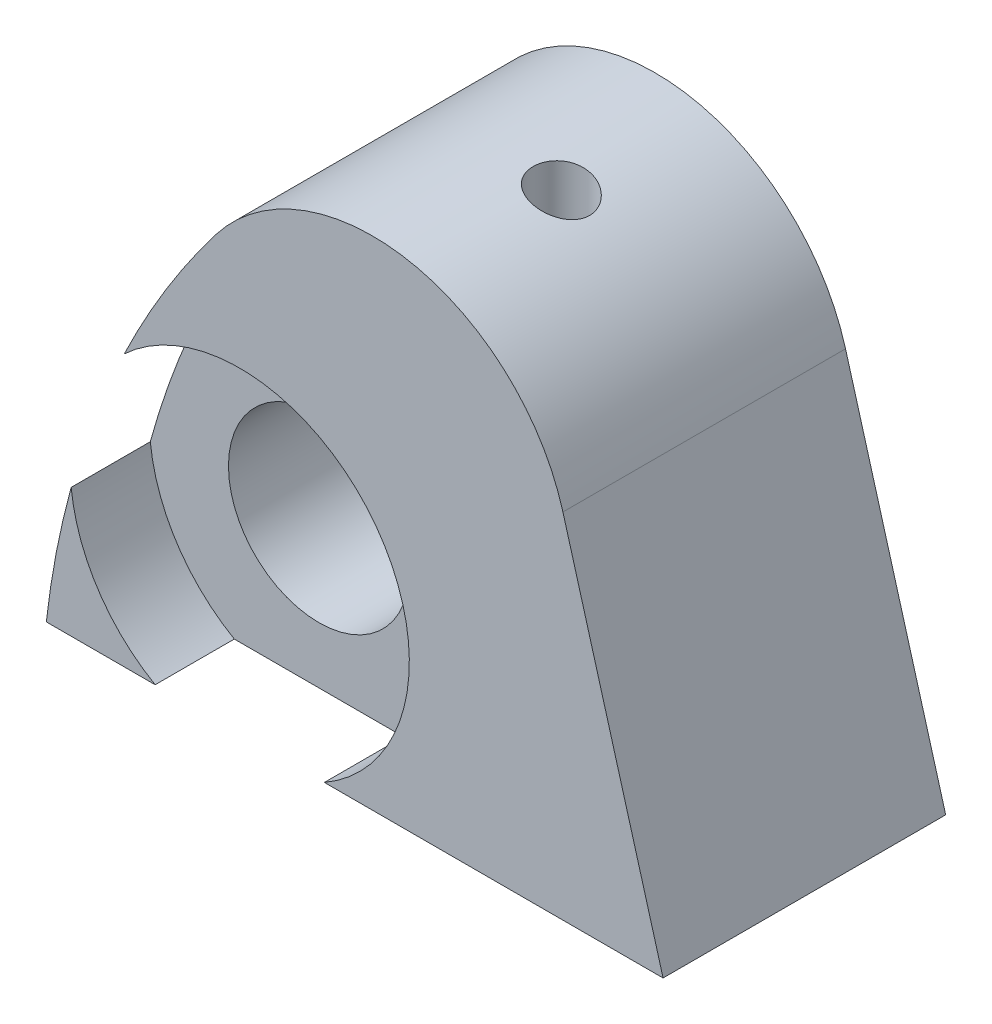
from build123d import *

# Parameters (mm, degrees)
EXTRUSION1_DEPTH        = 5
ESQUISSE2_R             = 1.6
ENL_V_MAT_EXTRU_1_DEPTH = 10.295907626
ESQUISSE3_R             = 3
ENL_V_MAT_EXTRU_2_DEPTH = 1.4
ESQUISSE4_R             = 1
ENL_V_MAT_EXTRU_3_DEPTH = 1.3
ESQUISSE5_R             = 0.5
ENL_V_MAT_EXTRU_4_DEPTH = 12.651776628
ESQUISSE6_R             = 1
ENL_V_MAT_EXTRU_5_DEPTH = 5
CHANFREIN1_SIZE         = 0.5


with BuildPart() as part:
    # Esquisse1 → Extrusion1 (new body)
    with BuildSketch(Plane.XY):
        with BuildLine():
            Line((-5.772685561, -5.3), (5.139536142, -5.3))
            Line((5.139536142, -5.3), (3.367430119, 0.954156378))
            ThreePointArc((3.367430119, 0.954156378), (0.656209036, 3.437933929), (-2.779245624, 2.127391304))
            ThreePointArc((-2.779245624, 2.127391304), (-4.780773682, -1.38285301), (-5.772685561, -5.3))
        make_face()
    extrude(amount=EXTRUSION1_DEPTH)

    # Esquisse2 → Enl_v. mat.-Extru.1 (cut, through all)
    with BuildSketch(Plane.XY.offset(5)):
        with Locations((-2.35, -2.7)):
            Circle(ESQUISSE2_R)
    extrude(amount=-ENL_V_MAT_EXTRU_1_DEPTH, mode=Mode.SUBTRACT)

    # Esquisse3 → Enl_v. mat.-Extru.2 (cut)
    with BuildSketch(Plane.XY.offset(5)):
        with Locations((-2.35, -2.7)):
            Circle(ESQUISSE3_R)
    extrude(amount=-ENL_V_MAT_EXTRU_2_DEPTH, mode=Mode.SUBTRACT)

    # Esquisse4 → Enl_v. mat.-Extru.3 (cut)
    with BuildSketch(Plane(origin=(0, 0, 0), x_dir=(-1, 0, 0), z_dir=(0, 0, -1))):
        Circle(ESQUISSE4_R)
    extrude(amount=-ENL_V_MAT_EXTRU_3_DEPTH, mode=Mode.SUBTRACT)

    # Esquisse5 → Enl_v. mat.-Extru.4 (cut, through all)
    with BuildSketch(Plane.XZ.offset(5.3)):
        with Locations((0.839536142, 2.5)):
            Circle(ESQUISSE5_R)
    extrude(amount=-ENL_V_MAT_EXTRU_4_DEPTH, mode=Mode.SUBTRACT)

    # Esquisse6 → Enl_v. mat.-Extru.5 (cut)
    with BuildSketch(Plane.XZ.offset(5.3)):
        with Locations((0.839536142, 2.5)):
            Circle(ESQUISSE6_R)
    extrude(amount=-ENL_V_MAT_EXTRU_5_DEPTH, mode=Mode.SUBTRACT)

    # Chanfrein1
    chanfrein1_edges = [part.edges().sort_by_distance(p)[0] for p in [
        (-0.160463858, -5.3, 2.5),
    ]]
    chamfer(chanfrein1_edges, length=CHANFREIN1_SIZE)


solid = part.part
